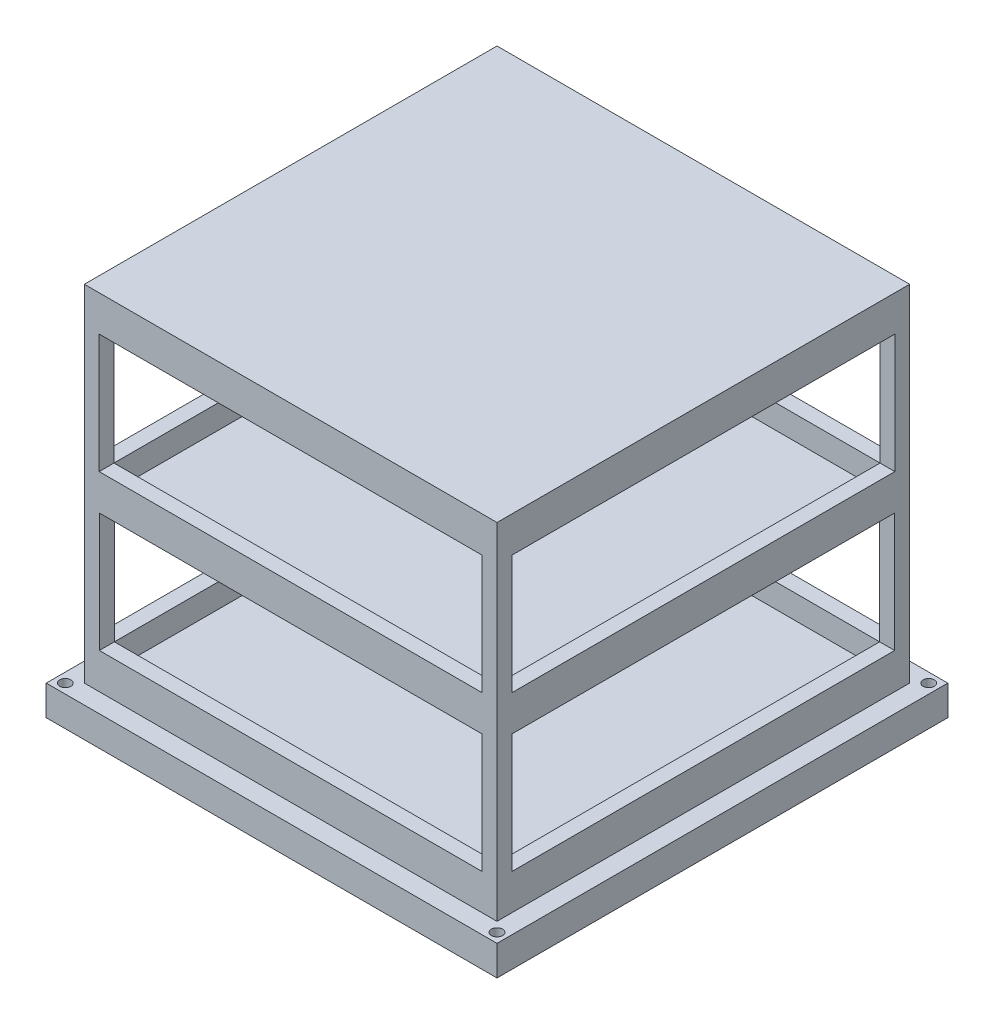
ISO-10303-21;
HEADER;
FILE_DESCRIPTION(('STEP AP214'),'2;1');
FILE_NAME('part.step','',(''),(''),'','','');
FILE_SCHEMA(('AUTOMOTIVE_DESIGN { 1 0 10303 214 1 1 1 1 }'));
ENDSEC;
DATA;
#1=APPLICATION_CONTEXT('core data for automotive mechanical design processes');
#2=APPLICATION_PROTOCOL_DEFINITION('international standard','automotive_design',2000,#1);
#3=PRODUCT_CONTEXT('',#1,'mechanical');
#4=PRODUCT('Part','Part','',(#3));
#5=PRODUCT_RELATED_PRODUCT_CATEGORY('part','',(#4));
#6=PRODUCT_DEFINITION_FORMATION('','',#4);
#7=PRODUCT_DEFINITION_CONTEXT('part definition',#1,'design');
#8=PRODUCT_DEFINITION('design','',#6,#7);
#9=PRODUCT_DEFINITION_SHAPE('','',#8);
#10=(LENGTH_UNIT() NAMED_UNIT(*) SI_UNIT(.MILLI.,.METRE.));
#11=(NAMED_UNIT(*) PLANE_ANGLE_UNIT() SI_UNIT($,.RADIAN.));
#12=(NAMED_UNIT(*) SI_UNIT($,.STERADIAN.) SOLID_ANGLE_UNIT());
#13=UNCERTAINTY_MEASURE_WITH_UNIT(LENGTH_MEASURE(1.E-05),#10,'distance_accuracy_value','');
#14=(GEOMETRIC_REPRESENTATION_CONTEXT(3) GLOBAL_UNCERTAINTY_ASSIGNED_CONTEXT((#13)) GLOBAL_UNIT_ASSIGNED_CONTEXT((#10,
#11,#12)) REPRESENTATION_CONTEXT('',''));
#15=CARTESIAN_POINT('',(0.,0.,0.));
#16=DIRECTION('',(0.,0.,1.));
#17=DIRECTION('',(1.,0.,0.));
#18=AXIS2_PLACEMENT_3D('',#15,#16,#17);
#19=CARTESIAN_POINT('',(0.,50.8,0.));
#20=DIRECTION('',(0.,1.,0.));
#21=DIRECTION('',(0.,0.,1.));
#22=AXIS2_PLACEMENT_3D('',#19,#20,#21);
#23=PLANE('',#22);
#24=DIRECTION('',(1.,0.,0.));
#25=VECTOR('',#24,1.);
#26=CARTESIAN_POINT('',(-51.054,50.8,51.054));
#27=LINE('',#26,#25);
#28=CARTESIAN_POINT('',(-51.054,50.8,51.054));
#29=VERTEX_POINT('',#28);
#30=CARTESIAN_POINT('',(51.054,50.8,51.054));
#31=VERTEX_POINT('',#30);
#32=EDGE_CURVE('E403',#29,#31,#27,.T.);
#33=ORIENTED_EDGE('',*,*,#32,.F.);
#34=DIRECTION('',(0.,0.,-1.));
#35=VECTOR('',#34,1.);
#36=CARTESIAN_POINT('',(-51.054,50.8,55.));
#37=LINE('',#36,#35);
#38=CARTESIAN_POINT('',(-51.054,50.8,55.));
#39=VERTEX_POINT('',#38);
#40=EDGE_CURVE('E331',#39,#29,#37,.T.);
#41=ORIENTED_EDGE('',*,*,#40,.F.);
#42=DIRECTION('',(1.,0.,0.));
#43=VECTOR('',#42,1.);
#44=CARTESIAN_POINT('',(-55.,50.8,55.));
#45=LINE('',#44,#43);
#46=CARTESIAN_POINT('',(51.054,50.8,55.));
#47=VERTEX_POINT('',#46);
#48=EDGE_CURVE('E436',#39,#47,#45,.T.);
#49=ORIENTED_EDGE('',*,*,#48,.T.);
#50=DIRECTION('',(0.,0.,1.));
#51=VECTOR('',#50,1.);
#52=CARTESIAN_POINT('',(51.054,50.8,55.));
#53=LINE('',#52,#51);
#54=EDGE_CURVE('E349',#31,#47,#53,.T.);
#55=ORIENTED_EDGE('',*,*,#54,.F.);
#56=EDGE_LOOP('',(#33,#41,#49,#55));
#57=FACE_BOUND('',#56,.T.);
#58=ADVANCED_FACE('F43',(#57),#23,.T.);
#59=DIRECTION('',(0.,0.,1.));
#60=VECTOR('',#59,1.);
#61=CARTESIAN_POINT('',(-55.,50.8,-55.));
#62=LINE('',#61,#60);
#63=CARTESIAN_POINT('',(-55.,50.8,-51.054));
#64=VERTEX_POINT('',#63);
#65=CARTESIAN_POINT('',(-55.,50.8,51.054));
#66=VERTEX_POINT('',#65);
#67=EDGE_CURVE('E58',#64,#66,#62,.T.);
#68=ORIENTED_EDGE('',*,*,#67,.T.);
#69=DIRECTION('',(-1.,0.,0.));
#70=VECTOR('',#69,1.);
#71=CARTESIAN_POINT('',(-55.,50.8,51.054));
#72=LINE('',#71,#70);
#73=EDGE_CURVE('E329',#29,#66,#72,.T.);
#74=ORIENTED_EDGE('',*,*,#73,.F.);
#75=DIRECTION('',(0.,0.,1.));
#76=VECTOR('',#75,1.);
#77=CARTESIAN_POINT('',(-51.054,50.8,51.054));
#78=LINE('',#77,#76);
#79=CARTESIAN_POINT('',(-51.054,50.8,-51.054));
#80=VERTEX_POINT('',#79);
#81=EDGE_CURVE('E418',#80,#29,#78,.T.);
#82=ORIENTED_EDGE('',*,*,#81,.F.);
#83=DIRECTION('',(1.,0.,0.));
#84=VECTOR('',#83,1.);
#85=CARTESIAN_POINT('',(-55.,50.8,-51.054));
#86=LINE('',#85,#84);
#87=EDGE_CURVE('E373',#64,#80,#86,.T.);
#88=ORIENTED_EDGE('',*,*,#87,.F.);
#89=EDGE_LOOP('',(#68,#74,#82,#88));
#90=FACE_BOUND('',#89,.T.);
#91=ADVANCED_FACE('F705',(#90),#23,.T.);
#92=DIRECTION('',(0.,0.,-1.));
#93=VECTOR('',#92,1.);
#94=CARTESIAN_POINT('',(51.054,50.8,51.054));
#95=LINE('',#94,#93);
#96=CARTESIAN_POINT('',(51.054,50.8,-51.054));
#97=VERTEX_POINT('',#96);
#98=EDGE_CURVE('E398',#31,#97,#95,.T.);
#99=ORIENTED_EDGE('',*,*,#98,.F.);
#100=DIRECTION('',(-1.,0.,0.));
#101=VECTOR('',#100,1.);
#102=CARTESIAN_POINT('',(55.,50.8,51.054));
#103=LINE('',#102,#101);
#104=CARTESIAN_POINT('',(55.,50.8,51.054));
#105=VERTEX_POINT('',#104);
#106=EDGE_CURVE('E66',#105,#31,#103,.T.);
#107=ORIENTED_EDGE('',*,*,#106,.F.);
#108=DIRECTION('',(0.,0.,-1.));
#109=VECTOR('',#108,1.);
#110=CARTESIAN_POINT('',(55.,50.8,-55.));
#111=LINE('',#110,#109);
#112=CARTESIAN_POINT('',(55.,50.8,-51.054));
#113=VERTEX_POINT('',#112);
#114=EDGE_CURVE('E439',#105,#113,#111,.T.);
#115=ORIENTED_EDGE('',*,*,#114,.T.);
#116=DIRECTION('',(1.,0.,0.));
#117=VECTOR('',#116,1.);
#118=CARTESIAN_POINT('',(55.,50.8,-51.054));
#119=LINE('',#118,#117);
#120=EDGE_CURVE('E366',#97,#113,#119,.T.);
#121=ORIENTED_EDGE('',*,*,#120,.F.);
#122=EDGE_LOOP('',(#99,#107,#115,#121));
#123=FACE_BOUND('',#122,.T.);
#124=ADVANCED_FACE('F667',(#123),#23,.T.);
#125=DIRECTION('',(-1.,0.,0.));
#126=VECTOR('',#125,1.);
#127=CARTESIAN_POINT('',(-51.054,50.8,-51.054));
#128=LINE('',#127,#126);
#129=EDGE_CURVE('E415',#97,#80,#128,.T.);
#130=ORIENTED_EDGE('',*,*,#129,.F.);
#131=DIRECTION('',(0.,0.,1.));
#132=VECTOR('',#131,1.);
#133=CARTESIAN_POINT('',(51.054,50.8,-55.));
#134=LINE('',#133,#132);
#135=CARTESIAN_POINT('',(51.054,50.8,-55.));
#136=VERTEX_POINT('',#135);
#137=EDGE_CURVE('E369',#136,#97,#134,.T.);
#138=ORIENTED_EDGE('',*,*,#137,.F.);
#139=DIRECTION('',(-1.,0.,0.));
#140=VECTOR('',#139,1.);
#141=CARTESIAN_POINT('',(-55.,50.8,-55.));
#142=LINE('',#141,#140);
#143=CARTESIAN_POINT('',(-51.054,50.8,-55.));
#144=VERTEX_POINT('',#143);
#145=EDGE_CURVE('E441',#136,#144,#142,.T.);
#146=ORIENTED_EDGE('',*,*,#145,.T.);
#147=DIRECTION('',(0.,0.,-1.));
#148=VECTOR('',#147,1.);
#149=CARTESIAN_POINT('',(-51.054,50.8,-55.));
#150=LINE('',#149,#148);
#151=EDGE_CURVE('E382',#80,#144,#150,.T.);
#152=ORIENTED_EDGE('',*,*,#151,.F.);
#153=EDGE_LOOP('',(#130,#138,#146,#152));
#154=FACE_BOUND('',#153,.T.);
#155=ADVANCED_FACE('F678',(#154),#23,.T.);
#156=CARTESIAN_POINT('',(0.,9.525,0.));
#157=DIRECTION('',(0.,-1.,0.));
#158=DIRECTION('',(0.,0.,-1.));
#159=AXIS2_PLACEMENT_3D('',#156,#157,#158);
#160=PLANE('',#159);
#161=DIRECTION('',(0.,0.,1.));
#162=VECTOR('',#161,1.);
#163=CARTESIAN_POINT('',(51.,9.525,-55.));
#164=LINE('',#163,#162);
#165=CARTESIAN_POINT('',(51.,9.525,-55.));
#166=VERTEX_POINT('',#165);
#167=CARTESIAN_POINT('',(51.,9.525,-51.));
#168=VERTEX_POINT('',#167);
#169=EDGE_CURVE('E466',#166,#168,#164,.T.);
#170=ORIENTED_EDGE('',*,*,#169,.F.);
#171=DIRECTION('',(-1.,0.,0.));
#172=VECTOR('',#171,1.);
#173=CARTESIAN_POINT('',(-55.,9.525,-55.));
#174=LINE('',#173,#172);
#175=CARTESIAN_POINT('',(-51.,9.525,-55.));
#176=VERTEX_POINT('',#175);
#177=EDGE_CURVE('E630',#166,#176,#174,.T.);
#178=ORIENTED_EDGE('',*,*,#177,.T.);
#179=DIRECTION('',(0.,0.,-1.));
#180=VECTOR('',#179,1.);
#181=CARTESIAN_POINT('',(-51.,9.525,-55.));
#182=LINE('',#181,#180);
#183=CARTESIAN_POINT('',(-51.,9.525,-51.));
#184=VERTEX_POINT('',#183);
#185=EDGE_CURVE('E521',#184,#176,#182,.T.);
#186=ORIENTED_EDGE('',*,*,#185,.F.);
#187=DIRECTION('',(-1.,0.,0.));
#188=VECTOR('',#187,1.);
#189=CARTESIAN_POINT('',(-51.,9.525,-51.));
#190=LINE('',#189,#188);
#191=EDGE_CURVE('E554',#168,#184,#190,.T.);
#192=ORIENTED_EDGE('',*,*,#191,.F.);
#193=EDGE_LOOP('',(#170,#178,#186,#192));
#194=FACE_BOUND('',#193,.T.);
#195=ADVANCED_FACE('F715',(#194),#160,.F.);
#196=DIRECTION('',(1.,0.,0.));
#197=VECTOR('',#196,1.);
#198=CARTESIAN_POINT('',(55.,9.525,-51.));
#199=LINE('',#198,#197);
#200=CARTESIAN_POINT('',(55.,9.525,-51.));
#201=VERTEX_POINT('',#200);
#202=EDGE_CURVE('E463',#168,#201,#199,.T.);
#203=ORIENTED_EDGE('',*,*,#202,.F.);
#204=DIRECTION('',(0.,0.,-1.));
#205=VECTOR('',#204,1.);
#206=CARTESIAN_POINT('',(51.,9.525,51.));
#207=LINE('',#206,#205);
#208=CARTESIAN_POINT('',(51.,9.525,51.));
#209=VERTEX_POINT('',#208);
#210=EDGE_CURVE('E537',#209,#168,#207,.T.);
#211=ORIENTED_EDGE('',*,*,#210,.F.);
#212=DIRECTION('',(-1.,0.,0.));
#213=VECTOR('',#212,1.);
#214=CARTESIAN_POINT('',(55.,9.525,51.));
#215=LINE('',#214,#213);
#216=CARTESIAN_POINT('',(55.,9.525,51.));
#217=VERTEX_POINT('',#216);
#218=EDGE_CURVE('E487',#217,#209,#215,.T.);
#219=ORIENTED_EDGE('',*,*,#218,.F.);
#220=DIRECTION('',(0.,0.,-1.));
#221=VECTOR('',#220,1.);
#222=CARTESIAN_POINT('',(55.,9.525,55.));
#223=LINE('',#222,#221);
#224=EDGE_CURVE('E628',#217,#201,#223,.T.);
#225=ORIENTED_EDGE('',*,*,#224,.T.);
#226=EDGE_LOOP('',(#203,#211,#219,#225));
#227=FACE_BOUND('',#226,.T.);
#228=ADVANCED_FACE('F814',(#227),#160,.F.);
#229=DIRECTION('',(0.,0.,1.));
#230=VECTOR('',#229,1.);
#231=CARTESIAN_POINT('',(51.,9.525,55.));
#232=LINE('',#231,#230);
#233=CARTESIAN_POINT('',(51.,9.525,55.));
#234=VERTEX_POINT('',#233);
#235=EDGE_CURVE('E484',#209,#234,#232,.T.);
#236=ORIENTED_EDGE('',*,*,#235,.F.);
#237=DIRECTION('',(1.,0.,0.));
#238=VECTOR('',#237,1.);
#239=CARTESIAN_POINT('',(-51.,9.525,51.));
#240=LINE('',#239,#238);
#241=CARTESIAN_POINT('',(-51.,9.525,51.));
#242=VERTEX_POINT('',#241);
#243=EDGE_CURVE('E542',#242,#209,#240,.T.);
#244=ORIENTED_EDGE('',*,*,#243,.F.);
#245=DIRECTION('',(0.,0.,-1.));
#246=VECTOR('',#245,1.);
#247=CARTESIAN_POINT('',(-51.,9.525,55.));
#248=LINE('',#247,#246);
#249=CARTESIAN_POINT('',(-51.,9.525,55.));
#250=VERTEX_POINT('',#249);
#251=EDGE_CURVE('E508',#250,#242,#248,.T.);
#252=ORIENTED_EDGE('',*,*,#251,.F.);
#253=DIRECTION('',(1.,0.,0.));
#254=VECTOR('',#253,1.);
#255=CARTESIAN_POINT('',(-55.,9.525,55.));
#256=LINE('',#255,#254);
#257=EDGE_CURVE('E635',#250,#234,#256,.T.);
#258=ORIENTED_EDGE('',*,*,#257,.T.);
#259=EDGE_LOOP('',(#236,#244,#252,#258));
#260=FACE_BOUND('',#259,.T.);
#261=ADVANCED_FACE('F1039',(#260),#160,.F.);
#262=DIRECTION('',(-1.,0.,0.));
#263=VECTOR('',#262,1.);
#264=CARTESIAN_POINT('',(-55.,9.525,51.));
#265=LINE('',#264,#263);
#266=CARTESIAN_POINT('',(-55.,9.525,51.));
#267=VERTEX_POINT('',#266);
#268=EDGE_CURVE('E505',#242,#267,#265,.T.);
#269=ORIENTED_EDGE('',*,*,#268,.F.);
#270=DIRECTION('',(0.,0.,1.));
#271=VECTOR('',#270,1.);
#272=CARTESIAN_POINT('',(-51.,9.525,51.));
#273=LINE('',#272,#271);
#274=EDGE_CURVE('E557',#184,#242,#273,.T.);
#275=ORIENTED_EDGE('',*,*,#274,.F.);
#276=DIRECTION('',(1.,0.,0.));
#277=VECTOR('',#276,1.);
#278=CARTESIAN_POINT('',(-55.,9.525,-51.));
#279=LINE('',#278,#277);
#280=CARTESIAN_POINT('',(-55.,9.525,-51.));
#281=VERTEX_POINT('',#280);
#282=EDGE_CURVE('E512',#281,#184,#279,.T.);
#283=ORIENTED_EDGE('',*,*,#282,.F.);
#284=DIRECTION('',(0.,0.,1.));
#285=VECTOR('',#284,1.);
#286=CARTESIAN_POINT('',(-55.,9.525,55.));
#287=LINE('',#286,#285);
#288=EDGE_CURVE('E633',#281,#267,#287,.T.);
#289=ORIENTED_EDGE('',*,*,#288,.T.);
#290=EDGE_LOOP('',(#269,#275,#283,#289));
#291=FACE_BOUND('',#290,.T.);
#292=ADVANCED_FACE('F652',(#291),#160,.F.);
#293=CARTESIAN_POINT('',(55.,9.525,55.));
#294=DIRECTION('',(-1.,0.,0.));
#295=DIRECTION('',(0.,0.,1.));
#296=AXIS2_PLACEMENT_3D('',#293,#294,#295);
#297=PLANE('',#296);
#298=DIRECTION('',(0.,-1.,0.));
#299=VECTOR('',#298,1.);
#300=CARTESIAN_POINT('',(55.,9.525,-55.));
#301=LINE('',#300,#299);
#302=CARTESIAN_POINT('',(55.,92.075,-55.));
#303=VERTEX_POINT('',#302);
#304=CARTESIAN_POINT('',(55.,0.,-55.));
#305=VERTEX_POINT('',#304);
#306=EDGE_CURVE('E11',#303,#305,#301,.T.);
#307=ORIENTED_EDGE('',*,*,#306,.F.);
#308=DIRECTION('',(0.,0.,-1.));
#309=VECTOR('',#308,1.);
#310=CARTESIAN_POINT('',(55.,92.075,-55.));
#311=LINE('',#310,#309);
#312=CARTESIAN_POINT('',(55.,92.075,55.));
#313=VERTEX_POINT('',#312);
#314=EDGE_CURVE('E297',#313,#303,#311,.T.);
#315=ORIENTED_EDGE('',*,*,#314,.F.);
#316=DIRECTION('',(0.,-1.,0.));
#317=VECTOR('',#316,1.);
#318=CARTESIAN_POINT('',(55.,9.525,55.));
#319=LINE('',#318,#317);
#320=CARTESIAN_POINT('',(55.,0.,55.));
#321=VERTEX_POINT('',#320);
#322=EDGE_CURVE('E287',#313,#321,#319,.T.);
#323=ORIENTED_EDGE('',*,*,#322,.T.);
#324=DIRECTION('',(0.,0.,-1.));
#325=VECTOR('',#324,1.);
#326=CARTESIAN_POINT('',(55.,0.,55.));
#327=LINE('',#326,#325);
#328=EDGE_CURVE('E627',#321,#305,#327,.T.);
#329=ORIENTED_EDGE('',*,*,#328,.T.);
#330=EDGE_LOOP('',(#307,#315,#323,#329));
#331=FACE_BOUND('',#330,.T.);
#332=DIRECTION('',(0.,-1.,0.));
#333=VECTOR('',#332,1.);
#334=CARTESIAN_POINT('',(55.,41.275,51.));
#335=LINE('',#334,#333);
#336=CARTESIAN_POINT('',(55.,41.275,51.));
#337=VERTEX_POINT('',#336);
#338=EDGE_CURVE('E470',#337,#217,#335,.T.);
#339=ORIENTED_EDGE('',*,*,#338,.F.);
#340=DIRECTION('',(0.,0.,-1.));
#341=VECTOR('',#340,1.);
#342=CARTESIAN_POINT('',(55.,41.275,-55.));
#343=LINE('',#342,#341);
#344=CARTESIAN_POINT('',(55.,41.275,-51.));
#345=VERTEX_POINT('',#344);
#346=EDGE_CURVE('E449',#337,#345,#343,.T.);
#347=ORIENTED_EDGE('',*,*,#346,.T.);
#348=DIRECTION('',(0.,-1.,0.));
#349=VECTOR('',#348,1.);
#350=CARTESIAN_POINT('',(55.,41.275,-51.));
#351=LINE('',#350,#349);
#352=EDGE_CURVE('E459',#345,#201,#351,.T.);
#353=ORIENTED_EDGE('',*,*,#352,.T.);
#354=ORIENTED_EDGE('',*,*,#224,.F.);
#355=EDGE_LOOP('',(#339,#347,#353,#354));
#356=FACE_BOUND('',#355,.T.);
#357=DIRECTION('',(0.,0.,-1.));
#358=VECTOR('',#357,1.);
#359=CARTESIAN_POINT('',(55.,82.55,-55.));
#360=LINE('',#359,#358);
#361=CARTESIAN_POINT('',(55.,82.55,51.054));
#362=VERTEX_POINT('',#361);
#363=CARTESIAN_POINT('',(55.,82.55,-51.054));
#364=VERTEX_POINT('',#363);
#365=EDGE_CURVE('E306',#362,#364,#360,.T.);
#366=ORIENTED_EDGE('',*,*,#365,.T.);
#367=DIRECTION('',(0.,-1.,0.));
#368=VECTOR('',#367,1.);
#369=CARTESIAN_POINT('',(55.,82.55,-51.054));
#370=LINE('',#369,#368);
#371=EDGE_CURVE('E362',#364,#113,#370,.T.);
#372=ORIENTED_EDGE('',*,*,#371,.T.);
#373=ORIENTED_EDGE('',*,*,#114,.F.);
#374=DIRECTION('',(0.,-1.,0.));
#375=VECTOR('',#374,1.);
#376=CARTESIAN_POINT('',(55.,82.55,51.054));
#377=LINE('',#376,#375);
#378=EDGE_CURVE('E335',#362,#105,#377,.T.);
#379=ORIENTED_EDGE('',*,*,#378,.F.);
#380=EDGE_LOOP('',(#366,#372,#373,#379));
#381=FACE_BOUND('',#380,.T.);
#382=ADVANCED_FACE('F45',(#331,#356,#381),#297,.F.);
#383=CARTESIAN_POINT('',(-55.,9.525,-55.));
#384=DIRECTION('',(0.,0.,1.));
#385=DIRECTION('',(1.,0.,0.));
#386=AXIS2_PLACEMENT_3D('',#383,#384,#385);
#387=PLANE('',#386);
#388=DIRECTION('',(0.,-1.,0.));
#389=VECTOR('',#388,1.);
#390=CARTESIAN_POINT('',(-55.,9.525,-55.));
#391=LINE('',#390,#389);
#392=CARTESIAN_POINT('',(-55.,92.075,-55.));
#393=VERTEX_POINT('',#392);
#394=CARTESIAN_POINT('',(-55.,0.,-55.));
#395=VERTEX_POINT('',#394);
#396=EDGE_CURVE('E51',#393,#395,#391,.T.);
#397=ORIENTED_EDGE('',*,*,#396,.F.);
#398=DIRECTION('',(-1.,0.,0.));
#399=VECTOR('',#398,1.);
#400=CARTESIAN_POINT('',(-55.,92.075,-55.));
#401=LINE('',#400,#399);
#402=EDGE_CURVE('E302',#303,#393,#401,.T.);
#403=ORIENTED_EDGE('',*,*,#402,.F.);
#404=ORIENTED_EDGE('',*,*,#306,.T.);
#405=DIRECTION('',(-1.,0.,0.));
#406=VECTOR('',#405,1.);
#407=CARTESIAN_POINT('',(-55.,0.,-55.));
#408=LINE('',#407,#406);
#409=EDGE_CURVE('E639',#305,#395,#408,.T.);
#410=ORIENTED_EDGE('',*,*,#409,.T.);
#411=EDGE_LOOP('',(#397,#403,#404,#410));
#412=FACE_BOUND('',#411,.T.);
#413=DIRECTION('',(-1.,0.,0.));
#414=VECTOR('',#413,1.);
#415=CARTESIAN_POINT('',(-55.,82.55,-55.));
#416=LINE('',#415,#414);
#417=CARTESIAN_POINT('',(51.054,82.55,-55.));
#418=VERTEX_POINT('',#417);
#419=CARTESIAN_POINT('',(-51.054,82.55,-55.));
#420=VERTEX_POINT('',#419);
#421=EDGE_CURVE('E303',#418,#420,#416,.T.);
#422=ORIENTED_EDGE('',*,*,#421,.T.);
#423=DIRECTION('',(0.,-1.,0.));
#424=VECTOR('',#423,1.);
#425=CARTESIAN_POINT('',(-51.054,82.55,-55.));
#426=LINE('',#425,#424);
#427=EDGE_CURVE('E385',#420,#144,#426,.T.);
#428=ORIENTED_EDGE('',*,*,#427,.T.);
#429=ORIENTED_EDGE('',*,*,#145,.F.);
#430=DIRECTION('',(0.,-1.,0.));
#431=VECTOR('',#430,1.);
#432=CARTESIAN_POINT('',(51.054,82.55,-55.));
#433=LINE('',#432,#431);
#434=EDGE_CURVE('E354',#418,#136,#433,.T.);
#435=ORIENTED_EDGE('',*,*,#434,.F.);
#436=EDGE_LOOP('',(#422,#428,#429,#435));
#437=FACE_BOUND('',#436,.T.);
#438=DIRECTION('',(-1.,0.,0.));
#439=VECTOR('',#438,1.);
#440=CARTESIAN_POINT('',(-55.,41.275,-55.));
#441=LINE('',#440,#439);
#442=CARTESIAN_POINT('',(51.,41.275,-55.));
#443=VERTEX_POINT('',#442);
#444=CARTESIAN_POINT('',(-51.,41.275,-55.));
#445=VERTEX_POINT('',#444);
#446=EDGE_CURVE('E437',#443,#445,#441,.T.);
#447=ORIENTED_EDGE('',*,*,#446,.T.);
#448=DIRECTION('',(0.,-1.,0.));
#449=VECTOR('',#448,1.);
#450=CARTESIAN_POINT('',(-51.,41.275,-55.));
#451=LINE('',#450,#449);
#452=EDGE_CURVE('E524',#445,#176,#451,.T.);
#453=ORIENTED_EDGE('',*,*,#452,.T.);
#454=ORIENTED_EDGE('',*,*,#177,.F.);
#455=DIRECTION('',(0.,-1.,0.));
#456=VECTOR('',#455,1.);
#457=CARTESIAN_POINT('',(51.,41.275,-55.));
#458=LINE('',#457,#456);
#459=EDGE_CURVE('E443',#443,#166,#458,.T.);
#460=ORIENTED_EDGE('',*,*,#459,.F.);
#461=EDGE_LOOP('',(#447,#453,#454,#460));
#462=FACE_BOUND('',#461,.T.);
#463=ADVANCED_FACE('F645',(#412,#437,#462),#387,.F.);
#464=CARTESIAN_POINT('',(-55.,9.525,55.));
#465=DIRECTION('',(1.,0.,0.));
#466=DIRECTION('',(0.,0.,-1.));
#467=AXIS2_PLACEMENT_3D('',#464,#465,#466);
#468=PLANE('',#467);
#469=DIRECTION('',(0.,-1.,0.));
#470=VECTOR('',#469,1.);
#471=CARTESIAN_POINT('',(-55.,82.55,-51.054));
#472=LINE('',#471,#470);
#473=CARTESIAN_POINT('',(-55.,82.55,-51.054));
#474=VERTEX_POINT('',#473);
#475=EDGE_CURVE('E395',#474,#64,#472,.T.);
#476=ORIENTED_EDGE('',*,*,#475,.F.);
#477=DIRECTION('',(0.,0.,1.));
#478=VECTOR('',#477,1.);
#479=CARTESIAN_POINT('',(-55.,82.55,-55.));
#480=LINE('',#479,#478);
#481=CARTESIAN_POINT('',(-55.,82.55,51.054));
#482=VERTEX_POINT('',#481);
#483=EDGE_CURVE('E312',#474,#482,#480,.T.);
#484=ORIENTED_EDGE('',*,*,#483,.T.);
#485=DIRECTION('',(0.,-1.,0.));
#486=VECTOR('',#485,1.);
#487=CARTESIAN_POINT('',(-55.,82.55,51.054));
#488=LINE('',#487,#486);
#489=EDGE_CURVE('E325',#482,#66,#488,.T.);
#490=ORIENTED_EDGE('',*,*,#489,.T.);
#491=ORIENTED_EDGE('',*,*,#67,.F.);
#492=EDGE_LOOP('',(#476,#484,#490,#491));
#493=FACE_BOUND('',#492,.T.);
#494=DIRECTION('',(0.,-1.,0.));
#495=VECTOR('',#494,1.);
#496=CARTESIAN_POINT('',(-55.,41.275,-51.));
#497=LINE('',#496,#495);
#498=CARTESIAN_POINT('',(-55.,41.275,-51.));
#499=VERTEX_POINT('',#498);
#500=EDGE_CURVE('E534',#499,#281,#497,.T.);
#501=ORIENTED_EDGE('',*,*,#500,.F.);
#502=DIRECTION('',(0.,0.,1.));
#503=VECTOR('',#502,1.);
#504=CARTESIAN_POINT('',(-55.,41.275,-55.));
#505=LINE('',#504,#503);
#506=CARTESIAN_POINT('',(-55.,41.275,51.));
#507=VERTEX_POINT('',#506);
#508=EDGE_CURVE('E426',#499,#507,#505,.T.);
#509=ORIENTED_EDGE('',*,*,#508,.T.);
#510=DIRECTION('',(0.,-1.,0.));
#511=VECTOR('',#510,1.);
#512=CARTESIAN_POINT('',(-55.,41.275,51.));
#513=LINE('',#512,#511);
#514=EDGE_CURVE('E501',#507,#267,#513,.T.);
#515=ORIENTED_EDGE('',*,*,#514,.T.);
#516=ORIENTED_EDGE('',*,*,#288,.F.);
#517=EDGE_LOOP('',(#501,#509,#515,#516));
#518=FACE_BOUND('',#517,.T.);
#519=DIRECTION('',(0.,0.,1.));
#520=VECTOR('',#519,1.);
#521=CARTESIAN_POINT('',(-55.,0.,55.));
#522=LINE('',#521,#520);
#523=CARTESIAN_POINT('',(-55.,0.,55.));
#524=VERTEX_POINT('',#523);
#525=EDGE_CURVE('E284',#395,#524,#522,.T.);
#526=ORIENTED_EDGE('',*,*,#525,.T.);
#527=DIRECTION('',(0.,-1.,0.));
#528=VECTOR('',#527,1.);
#529=CARTESIAN_POINT('',(-55.,9.525,55.));
#530=LINE('',#529,#528);
#531=CARTESIAN_POINT('',(-55.,92.075,55.));
#532=VERTEX_POINT('',#531);
#533=EDGE_CURVE('E278',#532,#524,#530,.T.);
#534=ORIENTED_EDGE('',*,*,#533,.F.);
#535=DIRECTION('',(0.,0.,1.));
#536=VECTOR('',#535,1.);
#537=CARTESIAN_POINT('',(-55.,92.075,-55.));
#538=LINE('',#537,#536);
#539=EDGE_CURVE('E283',#393,#532,#538,.T.);
#540=ORIENTED_EDGE('',*,*,#539,.F.);
#541=ORIENTED_EDGE('',*,*,#396,.T.);
#542=EDGE_LOOP('',(#526,#534,#540,#541));
#543=FACE_BOUND('',#542,.T.);
#544=ADVANCED_FACE('F280',(#493,#518,#543),#468,.F.);
#545=CARTESIAN_POINT('',(-55.,9.525,55.));
#546=DIRECTION('',(0.,0.,-1.));
#547=DIRECTION('',(-1.,0.,0.));
#548=AXIS2_PLACEMENT_3D('',#545,#546,#547);
#549=PLANE('',#548);
#550=ORIENTED_EDGE('',*,*,#322,.F.);
#551=DIRECTION('',(1.,0.,0.));
#552=VECTOR('',#551,1.);
#553=CARTESIAN_POINT('',(-55.,92.075,55.));
#554=LINE('',#553,#552);
#555=EDGE_CURVE('E290',#532,#313,#554,.T.);
#556=ORIENTED_EDGE('',*,*,#555,.F.);
#557=ORIENTED_EDGE('',*,*,#533,.T.);
#558=DIRECTION('',(1.,0.,0.));
#559=VECTOR('',#558,1.);
#560=CARTESIAN_POINT('',(-55.,0.,55.));
#561=LINE('',#560,#559);
#562=EDGE_CURVE('E631',#524,#321,#561,.T.);
#563=ORIENTED_EDGE('',*,*,#562,.T.);
#564=EDGE_LOOP('',(#550,#556,#557,#563));
#565=FACE_BOUND('',#564,.T.);
#566=DIRECTION('',(0.,-1.,0.));
#567=VECTOR('',#566,1.);
#568=CARTESIAN_POINT('',(-51.,41.275,55.));
#569=LINE('',#568,#567);
#570=CARTESIAN_POINT('',(-51.,41.275,55.));
#571=VERTEX_POINT('',#570);
#572=EDGE_CURVE('E491',#571,#250,#569,.T.);
#573=ORIENTED_EDGE('',*,*,#572,.F.);
#574=DIRECTION('',(1.,0.,0.));
#575=VECTOR('',#574,1.);
#576=CARTESIAN_POINT('',(-55.,41.275,55.));
#577=LINE('',#576,#575);
#578=CARTESIAN_POINT('',(51.,41.275,55.));
#579=VERTEX_POINT('',#578);
#580=EDGE_CURVE('E446',#571,#579,#577,.T.);
#581=ORIENTED_EDGE('',*,*,#580,.T.);
#582=DIRECTION('',(0.,-1.,0.));
#583=VECTOR('',#582,1.);
#584=CARTESIAN_POINT('',(51.,41.275,55.));
#585=LINE('',#584,#583);
#586=EDGE_CURVE('E480',#579,#234,#585,.T.);
#587=ORIENTED_EDGE('',*,*,#586,.T.);
#588=ORIENTED_EDGE('',*,*,#257,.F.);
#589=EDGE_LOOP('',(#573,#581,#587,#588));
#590=FACE_BOUND('',#589,.T.);
#591=DIRECTION('',(1.,0.,0.));
#592=VECTOR('',#591,1.);
#593=CARTESIAN_POINT('',(-55.,82.55,55.));
#594=LINE('',#593,#592);
#595=CARTESIAN_POINT('',(-51.054,82.55,55.));
#596=VERTEX_POINT('',#595);
#597=CARTESIAN_POINT('',(51.054,82.55,55.));
#598=VERTEX_POINT('',#597);
#599=EDGE_CURVE('E315',#596,#598,#594,.T.);
#600=ORIENTED_EDGE('',*,*,#599,.T.);
#601=DIRECTION('',(0.,-1.,0.));
#602=VECTOR('',#601,1.);
#603=CARTESIAN_POINT('',(51.054,82.55,55.));
#604=LINE('',#603,#602);
#605=EDGE_CURVE('E345',#598,#47,#604,.T.);
#606=ORIENTED_EDGE('',*,*,#605,.T.);
#607=ORIENTED_EDGE('',*,*,#48,.F.);
#608=DIRECTION('',(0.,-1.,0.));
#609=VECTOR('',#608,1.);
#610=CARTESIAN_POINT('',(-51.054,82.55,55.));
#611=LINE('',#610,#609);
#612=EDGE_CURVE('E311',#596,#39,#611,.T.);
#613=ORIENTED_EDGE('',*,*,#612,.F.);
#614=EDGE_LOOP('',(#600,#606,#607,#613));
#615=FACE_BOUND('',#614,.T.);
#616=ADVANCED_FACE('F291',(#565,#590,#615),#549,.F.);
#617=CARTESIAN_POINT('',(0.,0.,0.));
#618=DIRECTION('',(0.,1.,0.));
#619=DIRECTION('',(0.,0.,1.));
#620=AXIS2_PLACEMENT_3D('',#617,#618,#619);
#621=PLANE('',#620);
#622=CARTESIAN_POINT('',(-57.54,0.,57.54));
#623=DIRECTION('',(0.,1.,0.));
#624=DIRECTION('',(0.,0.,-1.));
#625=AXIS2_PLACEMENT_3D('',#622,#623,#624);
#626=CIRCLE('',#625,1.5);
#627=CARTESIAN_POINT('',(-57.54,0.,56.04));
#628=VERTEX_POINT('',#627);
#629=EDGE_CURVE('E587',#628,#628,#626,.T.);
#630=ORIENTED_EDGE('',*,*,#629,.F.);
#631=EDGE_LOOP('',(#630));
#632=FACE_BOUND('',#631,.T.);
#633=CARTESIAN_POINT('',(57.54,0.,57.54));
#634=DIRECTION('',(0.,1.,0.));
#635=DIRECTION('',(0.,0.,1.));
#636=AXIS2_PLACEMENT_3D('',#633,#634,#635);
#637=CIRCLE('',#636,1.5);
#638=CARTESIAN_POINT('',(57.54,0.,59.04));
#639=VERTEX_POINT('',#638);
#640=EDGE_CURVE('E581',#639,#639,#637,.T.);
#641=ORIENTED_EDGE('',*,*,#640,.F.);
#642=EDGE_LOOP('',(#641));
#643=FACE_BOUND('',#642,.T.);
#644=CARTESIAN_POINT('',(57.54,0.,-57.54));
#645=DIRECTION('',(0.,1.,0.));
#646=DIRECTION('',(0.,0.,-1.));
#647=AXIS2_PLACEMENT_3D('',#644,#645,#646);
#648=CIRCLE('',#647,1.5);
#649=CARTESIAN_POINT('',(57.54,0.,-59.04));
#650=VERTEX_POINT('',#649);
#651=EDGE_CURVE('E574',#650,#650,#648,.T.);
#652=ORIENTED_EDGE('',*,*,#651,.F.);
#653=EDGE_LOOP('',(#652));
#654=FACE_BOUND('',#653,.T.);
#655=CARTESIAN_POINT('',(-57.54,0.,-57.54));
#656=DIRECTION('',(0.,1.,0.));
#657=DIRECTION('',(0.,0.,1.));
#658=AXIS2_PLACEMENT_3D('',#655,#656,#657);
#659=CIRCLE('',#658,1.5);
#660=CARTESIAN_POINT('',(-57.54,0.,-56.04));
#661=VERTEX_POINT('',#660);
#662=EDGE_CURVE('E577',#661,#661,#659,.T.);
#663=ORIENTED_EDGE('',*,*,#662,.F.);
#664=EDGE_LOOP('',(#663));
#665=FACE_BOUND('',#664,.T.);
#666=DIRECTION('',(0.,0.,1.));
#667=VECTOR('',#666,1.);
#668=CARTESIAN_POINT('',(60.08,0.,-60.08));
#669=LINE('',#668,#667);
#670=CARTESIAN_POINT('',(60.08,0.,-60.08));
#671=VERTEX_POINT('',#670);
#672=CARTESIAN_POINT('',(60.08,0.,60.08));
#673=VERTEX_POINT('',#672);
#674=EDGE_CURVE('E595',#671,#673,#669,.T.);
#675=ORIENTED_EDGE('',*,*,#674,.F.);
#676=DIRECTION('',(1.,0.,0.));
#677=VECTOR('',#676,1.);
#678=CARTESIAN_POINT('',(-60.08,0.,-60.08));
#679=LINE('',#678,#677);
#680=CARTESIAN_POINT('',(-60.08,0.,-60.08));
#681=VERTEX_POINT('',#680);
#682=EDGE_CURVE('E602',#681,#671,#679,.T.);
#683=ORIENTED_EDGE('',*,*,#682,.F.);
#684=DIRECTION('',(0.,0.,-1.));
#685=VECTOR('',#684,1.);
#686=CARTESIAN_POINT('',(-60.08,0.,-60.08));
#687=LINE('',#686,#685);
#688=CARTESIAN_POINT('',(-60.08,0.,60.08));
#689=VERTEX_POINT('',#688);
#690=EDGE_CURVE('E613',#689,#681,#687,.T.);
#691=ORIENTED_EDGE('',*,*,#690,.F.);
#692=DIRECTION('',(-1.,0.,0.));
#693=VECTOR('',#692,1.);
#694=CARTESIAN_POINT('',(-60.08,0.,60.08));
#695=LINE('',#694,#693);
#696=EDGE_CURVE('E611',#673,#689,#695,.T.);
#697=ORIENTED_EDGE('',*,*,#696,.F.);
#698=EDGE_LOOP('',(#675,#683,#691,#697));
#699=FACE_BOUND('',#698,.T.);
#700=ORIENTED_EDGE('',*,*,#328,.F.);
#701=ORIENTED_EDGE('',*,*,#562,.F.);
#702=ORIENTED_EDGE('',*,*,#525,.F.);
#703=ORIENTED_EDGE('',*,*,#409,.F.);
#704=EDGE_LOOP('',(#700,#701,#702,#703));
#705=FACE_BOUND('',#704,.T.);
#706=ADVANCED_FACE('F648',(#632,#643,#654,#665,#699,#705),#621,.T.);
#707=CARTESIAN_POINT('',(60.08,-8.,-60.08));
#708=DIRECTION('',(-1.,0.,0.));
#709=DIRECTION('',(0.,0.,1.));
#710=AXIS2_PLACEMENT_3D('',#707,#708,#709);
#711=PLANE('',#710);
#712=ORIENTED_EDGE('',*,*,#674,.T.);
#713=DIRECTION('',(0.,1.,0.));
#714=VECTOR('',#713,1.);
#715=CARTESIAN_POINT('',(60.08,-8.,60.08));
#716=LINE('',#715,#714);
#717=CARTESIAN_POINT('',(60.08,-8.,60.08));
#718=VERTEX_POINT('',#717);
#719=EDGE_CURVE('E624',#718,#673,#716,.T.);
#720=ORIENTED_EDGE('',*,*,#719,.F.);
#721=DIRECTION('',(0.,0.,1.));
#722=VECTOR('',#721,1.);
#723=CARTESIAN_POINT('',(60.08,-8.,-60.08));
#724=LINE('',#723,#722);
#725=CARTESIAN_POINT('',(60.08,-8.,-60.08));
#726=VERTEX_POINT('',#725);
#727=EDGE_CURVE('E598',#726,#718,#724,.T.);
#728=ORIENTED_EDGE('',*,*,#727,.F.);
#729=DIRECTION('',(0.,1.,0.));
#730=VECTOR('',#729,1.);
#731=CARTESIAN_POINT('',(60.08,-8.,-60.08));
#732=LINE('',#731,#730);
#733=EDGE_CURVE('E608',#726,#671,#732,.T.);
#734=ORIENTED_EDGE('',*,*,#733,.T.);
#735=EDGE_LOOP('',(#712,#720,#728,#734));
#736=FACE_BOUND('',#735,.T.);
#737=ADVANCED_FACE('F796',(#736),#711,.F.);
#738=CARTESIAN_POINT('',(-60.08,-8.,60.08));
#739=DIRECTION('',(0.,0.,-1.));
#740=DIRECTION('',(-1.,0.,0.));
#741=AXIS2_PLACEMENT_3D('',#738,#739,#740);
#742=PLANE('',#741);
#743=ORIENTED_EDGE('',*,*,#696,.T.);
#744=DIRECTION('',(0.,1.,0.));
#745=VECTOR('',#744,1.);
#746=CARTESIAN_POINT('',(-60.08,-8.,60.08));
#747=LINE('',#746,#745);
#748=CARTESIAN_POINT('',(-60.08,-8.,60.08));
#749=VERTEX_POINT('',#748);
#750=EDGE_CURVE('E621',#749,#689,#747,.T.);
#751=ORIENTED_EDGE('',*,*,#750,.F.);
#752=DIRECTION('',(-1.,0.,0.));
#753=VECTOR('',#752,1.);
#754=CARTESIAN_POINT('',(-60.08,-8.,60.08));
#755=LINE('',#754,#753);
#756=EDGE_CURVE('E601',#718,#749,#755,.T.);
#757=ORIENTED_EDGE('',*,*,#756,.F.);
#758=ORIENTED_EDGE('',*,*,#719,.T.);
#759=EDGE_LOOP('',(#743,#751,#757,#758));
#760=FACE_BOUND('',#759,.T.);
#761=ADVANCED_FACE('F804',(#760),#742,.F.);
#762=CARTESIAN_POINT('',(-60.08,-8.,-60.08));
#763=DIRECTION('',(1.,0.,0.));
#764=DIRECTION('',(0.,0.,-1.));
#765=AXIS2_PLACEMENT_3D('',#762,#763,#764);
#766=PLANE('',#765);
#767=ORIENTED_EDGE('',*,*,#690,.T.);
#768=DIRECTION('',(0.,1.,0.));
#769=VECTOR('',#768,1.);
#770=CARTESIAN_POINT('',(-60.08,-8.,-60.08));
#771=LINE('',#770,#769);
#772=CARTESIAN_POINT('',(-60.08,-8.,-60.08));
#773=VERTEX_POINT('',#772);
#774=EDGE_CURVE('E618',#773,#681,#771,.T.);
#775=ORIENTED_EDGE('',*,*,#774,.F.);
#776=DIRECTION('',(0.,0.,-1.));
#777=VECTOR('',#776,1.);
#778=CARTESIAN_POINT('',(-60.08,-8.,-60.08));
#779=LINE('',#778,#777);
#780=EDGE_CURVE('E604',#749,#773,#779,.T.);
#781=ORIENTED_EDGE('',*,*,#780,.F.);
#782=ORIENTED_EDGE('',*,*,#750,.T.);
#783=EDGE_LOOP('',(#767,#775,#781,#782));
#784=FACE_BOUND('',#783,.T.);
#785=ADVANCED_FACE('F800',(#784),#766,.F.);
#786=CARTESIAN_POINT('',(-60.08,-8.,-60.08));
#787=DIRECTION('',(0.,0.,1.));
#788=DIRECTION('',(1.,0.,0.));
#789=AXIS2_PLACEMENT_3D('',#786,#787,#788);
#790=PLANE('',#789);
#791=ORIENTED_EDGE('',*,*,#682,.T.);
#792=ORIENTED_EDGE('',*,*,#733,.F.);
#793=DIRECTION('',(1.,0.,0.));
#794=VECTOR('',#793,1.);
#795=CARTESIAN_POINT('',(-60.08,-8.,-60.08));
#796=LINE('',#795,#794);
#797=EDGE_CURVE('E606',#773,#726,#796,.T.);
#798=ORIENTED_EDGE('',*,*,#797,.F.);
#799=ORIENTED_EDGE('',*,*,#774,.T.);
#800=EDGE_LOOP('',(#791,#792,#798,#799));
#801=FACE_BOUND('',#800,.T.);
#802=ADVANCED_FACE('F792',(#801),#790,.F.);
#803=CARTESIAN_POINT('',(0.,-8.,0.));
#804=DIRECTION('',(0.,1.,0.));
#805=DIRECTION('',(0.,0.,1.));
#806=AXIS2_PLACEMENT_3D('',#803,#804,#805);
#807=PLANE('',#806);
#808=CARTESIAN_POINT('',(-57.54,-8.,57.54));
#809=DIRECTION('',(0.,1.,0.));
#810=DIRECTION('',(0.,0.,-1.));
#811=AXIS2_PLACEMENT_3D('',#808,#809,#810);
#812=CIRCLE('',#811,1.5);
#813=CARTESIAN_POINT('',(-57.54,-8.,56.04));
#814=VERTEX_POINT('',#813);
#815=EDGE_CURVE('E565',#814,#814,#812,.T.);
#816=ORIENTED_EDGE('',*,*,#815,.T.);
#817=EDGE_LOOP('',(#816));
#818=FACE_BOUND('',#817,.T.);
#819=CARTESIAN_POINT('',(57.54,-8.,57.54));
#820=DIRECTION('',(0.,1.,0.));
#821=DIRECTION('',(0.,0.,1.));
#822=AXIS2_PLACEMENT_3D('',#819,#820,#821);
#823=CIRCLE('',#822,1.5);
#824=CARTESIAN_POINT('',(57.54,-8.,59.04));
#825=VERTEX_POINT('',#824);
#826=EDGE_CURVE('E584',#825,#825,#823,.T.);
#827=ORIENTED_EDGE('',*,*,#826,.T.);
#828=EDGE_LOOP('',(#827));
#829=FACE_BOUND('',#828,.T.);
#830=CARTESIAN_POINT('',(57.54,-8.,-57.54));
#831=DIRECTION('',(0.,1.,0.));
#832=DIRECTION('',(0.,0.,-1.));
#833=AXIS2_PLACEMENT_3D('',#830,#831,#832);
#834=CIRCLE('',#833,1.5);
#835=CARTESIAN_POINT('',(57.54,-8.,-59.04));
#836=VERTEX_POINT('',#835);
#837=EDGE_CURVE('E578',#836,#836,#834,.T.);
#838=ORIENTED_EDGE('',*,*,#837,.T.);
#839=EDGE_LOOP('',(#838));
#840=FACE_BOUND('',#839,.T.);
#841=CARTESIAN_POINT('',(-57.54,-8.,-57.54));
#842=DIRECTION('',(0.,1.,0.));
#843=DIRECTION('',(0.,0.,1.));
#844=AXIS2_PLACEMENT_3D('',#841,#842,#843);
#845=CIRCLE('',#844,1.5);
#846=CARTESIAN_POINT('',(-57.54,-8.,-56.04));
#847=VERTEX_POINT('',#846);
#848=EDGE_CURVE('E592',#847,#847,#845,.T.);
#849=ORIENTED_EDGE('',*,*,#848,.T.);
#850=EDGE_LOOP('',(#849));
#851=FACE_BOUND('',#850,.T.);
#852=ORIENTED_EDGE('',*,*,#727,.T.);
#853=ORIENTED_EDGE('',*,*,#756,.T.);
#854=ORIENTED_EDGE('',*,*,#780,.T.);
#855=ORIENTED_EDGE('',*,*,#797,.T.);
#856=EDGE_LOOP('',(#852,#853,#854,#855));
#857=FACE_BOUND('',#856,.T.);
#858=ADVANCED_FACE('F788',(#818,#829,#840,#851,#857),#807,.F.);
#859=CARTESIAN_POINT('',(-57.54,-8.,-57.54));
#860=DIRECTION('',(0.,1.,0.));
#861=DIRECTION('',(0.,0.,1.));
#862=AXIS2_PLACEMENT_3D('',#859,#860,#861);
#863=CYLINDRICAL_SURFACE('',#862,1.5);
#864=ORIENTED_EDGE('',*,*,#848,.F.);
#865=EDGE_LOOP('',(#864));
#866=FACE_BOUND('',#865,.T.);
#867=ORIENTED_EDGE('',*,*,#662,.T.);
#868=EDGE_LOOP('',(#867));
#869=FACE_BOUND('',#868,.T.);
#870=ADVANCED_FACE('F778',(#866,#869),#863,.F.);
#871=CARTESIAN_POINT('',(57.54,-8.,-57.54));
#872=DIRECTION('',(0.,1.,0.));
#873=DIRECTION('',(0.,0.,1.));
#874=AXIS2_PLACEMENT_3D('',#871,#872,#873);
#875=CYLINDRICAL_SURFACE('',#874,1.5);
#876=ORIENTED_EDGE('',*,*,#837,.F.);
#877=EDGE_LOOP('',(#876));
#878=FACE_BOUND('',#877,.T.);
#879=ORIENTED_EDGE('',*,*,#651,.T.);
#880=EDGE_LOOP('',(#879));
#881=FACE_BOUND('',#880,.T.);
#882=ADVANCED_FACE('F774',(#878,#881),#875,.F.);
#883=CARTESIAN_POINT('',(57.54,-8.,57.54));
#884=DIRECTION('',(0.,1.,0.));
#885=DIRECTION('',(0.,0.,1.));
#886=AXIS2_PLACEMENT_3D('',#883,#884,#885);
#887=CYLINDRICAL_SURFACE('',#886,1.5);
#888=ORIENTED_EDGE('',*,*,#826,.F.);
#889=EDGE_LOOP('',(#888));
#890=FACE_BOUND('',#889,.T.);
#891=ORIENTED_EDGE('',*,*,#640,.T.);
#892=EDGE_LOOP('',(#891));
#893=FACE_BOUND('',#892,.T.);
#894=ADVANCED_FACE('F777',(#890,#893),#887,.F.);
#895=CARTESIAN_POINT('',(-57.54,-8.,57.54));
#896=DIRECTION('',(0.,1.,0.));
#897=DIRECTION('',(0.,0.,1.));
#898=AXIS2_PLACEMENT_3D('',#895,#896,#897);
#899=CYLINDRICAL_SURFACE('',#898,1.5);
#900=ORIENTED_EDGE('',*,*,#815,.F.);
#901=EDGE_LOOP('',(#900));
#902=FACE_BOUND('',#901,.T.);
#903=ORIENTED_EDGE('',*,*,#629,.T.);
#904=EDGE_LOOP('',(#903));
#905=FACE_BOUND('',#904,.T.);
#906=ADVANCED_FACE('F772',(#902,#905),#899,.F.);
#907=CARTESIAN_POINT('',(51.,3.175,51.));
#908=DIRECTION('',(1.,0.,0.));
#909=DIRECTION('',(0.,0.,-1.));
#910=AXIS2_PLACEMENT_3D('',#907,#908,#909);
#911=PLANE('',#910);
#912=ORIENTED_EDGE('',*,*,#210,.T.);
#913=DIRECTION('',(0.,1.,0.));
#914=VECTOR('',#913,1.);
#915=CARTESIAN_POINT('',(51.,3.175,-51.));
#916=LINE('',#915,#914);
#917=CARTESIAN_POINT('',(51.,3.175,-51.));
#918=VERTEX_POINT('',#917);
#919=EDGE_CURVE('E551',#918,#168,#916,.T.);
#920=ORIENTED_EDGE('',*,*,#919,.F.);
#921=DIRECTION('',(0.,0.,-1.));
#922=VECTOR('',#921,1.);
#923=CARTESIAN_POINT('',(51.,3.175,51.));
#924=LINE('',#923,#922);
#925=CARTESIAN_POINT('',(51.,3.175,51.));
#926=VERTEX_POINT('',#925);
#927=EDGE_CURVE('E538',#926,#918,#924,.T.);
#928=ORIENTED_EDGE('',*,*,#927,.F.);
#929=DIRECTION('',(0.,1.,0.));
#930=VECTOR('',#929,1.);
#931=CARTESIAN_POINT('',(51.,3.175,51.));
#932=LINE('',#931,#930);
#933=EDGE_CURVE('E562',#926,#209,#932,.T.);
#934=ORIENTED_EDGE('',*,*,#933,.T.);
#935=EDGE_LOOP('',(#912,#920,#928,#934));
#936=FACE_BOUND('',#935,.T.);
#937=ADVANCED_FACE('F762',(#936),#911,.F.);
#938=CARTESIAN_POINT('',(-51.,3.175,51.));
#939=DIRECTION('',(0.,0.,1.));
#940=DIRECTION('',(1.,0.,0.));
#941=AXIS2_PLACEMENT_3D('',#938,#939,#940);
#942=PLANE('',#941);
#943=ORIENTED_EDGE('',*,*,#243,.T.);
#944=ORIENTED_EDGE('',*,*,#933,.F.);
#945=DIRECTION('',(1.,0.,0.));
#946=VECTOR('',#945,1.);
#947=CARTESIAN_POINT('',(-51.,3.175,51.));
#948=LINE('',#947,#946);
#949=CARTESIAN_POINT('',(-51.,3.175,51.));
#950=VERTEX_POINT('',#949);
#951=EDGE_CURVE('E548',#950,#926,#948,.T.);
#952=ORIENTED_EDGE('',*,*,#951,.F.);
#953=DIRECTION('',(0.,1.,0.));
#954=VECTOR('',#953,1.);
#955=CARTESIAN_POINT('',(-51.,3.175,51.));
#956=LINE('',#955,#954);
#957=EDGE_CURVE('E566',#950,#242,#956,.T.);
#958=ORIENTED_EDGE('',*,*,#957,.T.);
#959=EDGE_LOOP('',(#943,#944,#952,#958));
#960=FACE_BOUND('',#959,.T.);
#961=ADVANCED_FACE('F758',(#960),#942,.F.);
#962=CARTESIAN_POINT('',(-51.,3.175,51.));
#963=DIRECTION('',(-1.,0.,0.));
#964=DIRECTION('',(0.,0.,1.));
#965=AXIS2_PLACEMENT_3D('',#962,#963,#964);
#966=PLANE('',#965);
#967=ORIENTED_EDGE('',*,*,#274,.T.);
#968=ORIENTED_EDGE('',*,*,#957,.F.);
#969=DIRECTION('',(0.,0.,1.));
#970=VECTOR('',#969,1.);
#971=CARTESIAN_POINT('',(-51.,3.175,51.));
#972=LINE('',#971,#970);
#973=CARTESIAN_POINT('',(-51.,3.175,-51.));
#974=VERTEX_POINT('',#973);
#975=EDGE_CURVE('E545',#974,#950,#972,.T.);
#976=ORIENTED_EDGE('',*,*,#975,.F.);
#977=DIRECTION('',(0.,1.,0.));
#978=VECTOR('',#977,1.);
#979=CARTESIAN_POINT('',(-51.,3.175,-51.));
#980=LINE('',#979,#978);
#981=EDGE_CURVE('E569',#974,#184,#980,.T.);
#982=ORIENTED_EDGE('',*,*,#981,.T.);
#983=EDGE_LOOP('',(#967,#968,#976,#982));
#984=FACE_BOUND('',#983,.T.);
#985=ADVANCED_FACE('F761',(#984),#966,.F.);
#986=CARTESIAN_POINT('',(-51.,3.175,-51.));
#987=DIRECTION('',(0.,0.,-1.));
#988=DIRECTION('',(-1.,0.,0.));
#989=AXIS2_PLACEMENT_3D('',#986,#987,#988);
#990=PLANE('',#989);
#991=ORIENTED_EDGE('',*,*,#191,.T.);
#992=ORIENTED_EDGE('',*,*,#981,.F.);
#993=DIRECTION('',(-1.,0.,0.));
#994=VECTOR('',#993,1.);
#995=CARTESIAN_POINT('',(-51.,3.175,-51.));
#996=LINE('',#995,#994);
#997=EDGE_CURVE('E541',#918,#974,#996,.T.);
#998=ORIENTED_EDGE('',*,*,#997,.F.);
#999=ORIENTED_EDGE('',*,*,#919,.T.);
#1000=EDGE_LOOP('',(#991,#992,#998,#999));
#1001=FACE_BOUND('',#1000,.T.);
#1002=ADVANCED_FACE('F756',(#1001),#990,.F.);
#1003=CARTESIAN_POINT('',(0.,3.175,0.));
#1004=DIRECTION('',(0.,-1.,0.));
#1005=DIRECTION('',(0.,0.,-1.));
#1006=AXIS2_PLACEMENT_3D('',#1003,#1004,#1005);
#1007=PLANE('',#1006);
#1008=ORIENTED_EDGE('',*,*,#927,.T.);
#1009=ORIENTED_EDGE('',*,*,#997,.T.);
#1010=ORIENTED_EDGE('',*,*,#975,.T.);
#1011=ORIENTED_EDGE('',*,*,#951,.T.);
#1012=EDGE_LOOP('',(#1008,#1009,#1010,#1011));
#1013=FACE_BOUND('',#1012,.T.);
#1014=ADVANCED_FACE('F752',(#1013),#1007,.F.);
#1015=CARTESIAN_POINT('',(-55.,41.275,-51.));
#1016=DIRECTION('',(0.,0.,-1.));
#1017=DIRECTION('',(-1.,0.,0.));
#1018=AXIS2_PLACEMENT_3D('',#1015,#1016,#1017);
#1019=PLANE('',#1018);
#1020=ORIENTED_EDGE('',*,*,#282,.T.);
#1021=DIRECTION('',(0.,-1.,0.));
#1022=VECTOR('',#1021,1.);
#1023=CARTESIAN_POINT('',(-51.,41.275,-51.));
#1024=LINE('',#1023,#1022);
#1025=CARTESIAN_POINT('',(-51.,41.275,-51.));
#1026=VERTEX_POINT('',#1025);
#1027=EDGE_CURVE('E531',#1026,#184,#1024,.T.);
#1028=ORIENTED_EDGE('',*,*,#1027,.F.);
#1029=DIRECTION('',(1.,0.,0.));
#1030=VECTOR('',#1029,1.);
#1031=CARTESIAN_POINT('',(-55.,41.275,-51.));
#1032=LINE('',#1031,#1030);
#1033=EDGE_CURVE('E517',#499,#1026,#1032,.T.);
#1034=ORIENTED_EDGE('',*,*,#1033,.F.);
#1035=ORIENTED_EDGE('',*,*,#500,.T.);
#1036=EDGE_LOOP('',(#1020,#1028,#1034,#1035));
#1037=FACE_BOUND('',#1036,.T.);
#1038=ADVANCED_FACE('F748',(#1037),#1019,.F.);
#1039=CARTESIAN_POINT('',(-51.,41.275,-55.));
#1040=DIRECTION('',(-1.,0.,0.));
#1041=DIRECTION('',(0.,0.,1.));
#1042=AXIS2_PLACEMENT_3D('',#1039,#1040,#1041);
#1043=PLANE('',#1042);
#1044=ORIENTED_EDGE('',*,*,#185,.T.);
#1045=ORIENTED_EDGE('',*,*,#452,.F.);
#1046=DIRECTION('',(0.,0.,-1.));
#1047=VECTOR('',#1046,1.);
#1048=CARTESIAN_POINT('',(-51.,41.275,-55.));
#1049=LINE('',#1048,#1047);
#1050=EDGE_CURVE('E520',#1026,#445,#1049,.T.);
#1051=ORIENTED_EDGE('',*,*,#1050,.F.);
#1052=ORIENTED_EDGE('',*,*,#1027,.T.);
#1053=EDGE_LOOP('',(#1044,#1045,#1051,#1052));
#1054=FACE_BOUND('',#1053,.T.);
#1055=ADVANCED_FACE('F741',(#1054),#1043,.F.);
#1056=CARTESIAN_POINT('',(-51.,41.275,55.));
#1057=DIRECTION('',(-1.,0.,0.));
#1058=DIRECTION('',(0.,0.,1.));
#1059=AXIS2_PLACEMENT_3D('',#1056,#1057,#1058);
#1060=PLANE('',#1059);
#1061=ORIENTED_EDGE('',*,*,#251,.T.);
#1062=DIRECTION('',(0.,-1.,0.));
#1063=VECTOR('',#1062,1.);
#1064=CARTESIAN_POINT('',(-51.,41.275,51.));
#1065=LINE('',#1064,#1063);
#1066=CARTESIAN_POINT('',(-51.,41.275,51.));
#1067=VERTEX_POINT('',#1066);
#1068=EDGE_CURVE('E498',#1067,#242,#1065,.T.);
#1069=ORIENTED_EDGE('',*,*,#1068,.F.);
#1070=DIRECTION('',(0.,0.,-1.));
#1071=VECTOR('',#1070,1.);
#1072=CARTESIAN_POINT('',(-51.,41.275,55.));
#1073=LINE('',#1072,#1071);
#1074=EDGE_CURVE('E509',#571,#1067,#1073,.T.);
#1075=ORIENTED_EDGE('',*,*,#1074,.F.);
#1076=ORIENTED_EDGE('',*,*,#572,.T.);
#1077=EDGE_LOOP('',(#1061,#1069,#1075,#1076));
#1078=FACE_BOUND('',#1077,.T.);
#1079=ADVANCED_FACE('F738',(#1078),#1060,.F.);
#1080=CARTESIAN_POINT('',(-55.,41.275,51.));
#1081=DIRECTION('',(0.,0.,1.));
#1082=DIRECTION('',(1.,0.,0.));
#1083=AXIS2_PLACEMENT_3D('',#1080,#1081,#1082);
#1084=PLANE('',#1083);
#1085=ORIENTED_EDGE('',*,*,#268,.T.);
#1086=ORIENTED_EDGE('',*,*,#514,.F.);
#1087=DIRECTION('',(-1.,0.,0.));
#1088=VECTOR('',#1087,1.);
#1089=CARTESIAN_POINT('',(-55.,41.275,51.));
#1090=LINE('',#1089,#1088);
#1091=EDGE_CURVE('E504',#1067,#507,#1090,.T.);
#1092=ORIENTED_EDGE('',*,*,#1091,.F.);
#1093=ORIENTED_EDGE('',*,*,#1068,.T.);
#1094=EDGE_LOOP('',(#1085,#1086,#1092,#1093));
#1095=FACE_BOUND('',#1094,.T.);
#1096=ADVANCED_FACE('F733',(#1095),#1084,.F.);
#1097=CARTESIAN_POINT('',(55.,41.275,51.));
#1098=DIRECTION('',(0.,0.,1.));
#1099=DIRECTION('',(1.,0.,0.));
#1100=AXIS2_PLACEMENT_3D('',#1097,#1098,#1099);
#1101=PLANE('',#1100);
#1102=ORIENTED_EDGE('',*,*,#218,.T.);
#1103=DIRECTION('',(0.,-1.,0.));
#1104=VECTOR('',#1103,1.);
#1105=CARTESIAN_POINT('',(51.,41.275,51.));
#1106=LINE('',#1105,#1104);
#1107=CARTESIAN_POINT('',(51.,41.275,51.));
#1108=VERTEX_POINT('',#1107);
#1109=EDGE_CURVE('E477',#1108,#209,#1106,.T.);
#1110=ORIENTED_EDGE('',*,*,#1109,.F.);
#1111=DIRECTION('',(-1.,0.,0.));
#1112=VECTOR('',#1111,1.);
#1113=CARTESIAN_POINT('',(55.,41.275,51.));
#1114=LINE('',#1113,#1112);
#1115=EDGE_CURVE('E488',#337,#1108,#1114,.T.);
#1116=ORIENTED_EDGE('',*,*,#1115,.F.);
#1117=ORIENTED_EDGE('',*,*,#338,.T.);
#1118=EDGE_LOOP('',(#1102,#1110,#1116,#1117));
#1119=FACE_BOUND('',#1118,.T.);
#1120=ADVANCED_FACE('F730',(#1119),#1101,.F.);
#1121=CARTESIAN_POINT('',(51.,41.275,55.));
#1122=DIRECTION('',(1.,0.,0.));
#1123=DIRECTION('',(0.,0.,-1.));
#1124=AXIS2_PLACEMENT_3D('',#1121,#1122,#1123);
#1125=PLANE('',#1124);
#1126=ORIENTED_EDGE('',*,*,#235,.T.);
#1127=ORIENTED_EDGE('',*,*,#586,.F.);
#1128=DIRECTION('',(0.,0.,1.));
#1129=VECTOR('',#1128,1.);
#1130=CARTESIAN_POINT('',(51.,41.275,55.));
#1131=LINE('',#1130,#1129);
#1132=EDGE_CURVE('E483',#1108,#579,#1131,.T.);
#1133=ORIENTED_EDGE('',*,*,#1132,.F.);
#1134=ORIENTED_EDGE('',*,*,#1109,.T.);
#1135=EDGE_LOOP('',(#1126,#1127,#1133,#1134));
#1136=FACE_BOUND('',#1135,.T.);
#1137=ADVANCED_FACE('F725',(#1136),#1125,.F.);
#1138=CARTESIAN_POINT('',(51.,41.275,-55.));
#1139=DIRECTION('',(1.,0.,0.));
#1140=DIRECTION('',(0.,0.,-1.));
#1141=AXIS2_PLACEMENT_3D('',#1138,#1139,#1140);
#1142=PLANE('',#1141);
#1143=ORIENTED_EDGE('',*,*,#169,.T.);
#1144=DIRECTION('',(0.,-1.,0.));
#1145=VECTOR('',#1144,1.);
#1146=CARTESIAN_POINT('',(51.,41.275,-51.));
#1147=LINE('',#1146,#1145);
#1148=CARTESIAN_POINT('',(51.,41.275,-51.));
#1149=VERTEX_POINT('',#1148);
#1150=EDGE_CURVE('E456',#1149,#168,#1147,.T.);
#1151=ORIENTED_EDGE('',*,*,#1150,.F.);
#1152=DIRECTION('',(0.,0.,1.));
#1153=VECTOR('',#1152,1.);
#1154=CARTESIAN_POINT('',(51.,41.275,-55.));
#1155=LINE('',#1154,#1153);
#1156=EDGE_CURVE('E467',#443,#1149,#1155,.T.);
#1157=ORIENTED_EDGE('',*,*,#1156,.F.);
#1158=ORIENTED_EDGE('',*,*,#459,.T.);
#1159=EDGE_LOOP('',(#1143,#1151,#1157,#1158));
#1160=FACE_BOUND('',#1159,.T.);
#1161=ADVANCED_FACE('F722',(#1160),#1142,.F.);
#1162=CARTESIAN_POINT('',(55.,41.275,-51.));
#1163=DIRECTION('',(0.,0.,-1.));
#1164=DIRECTION('',(-1.,0.,0.));
#1165=AXIS2_PLACEMENT_3D('',#1162,#1163,#1164);
#1166=PLANE('',#1165);
#1167=ORIENTED_EDGE('',*,*,#202,.T.);
#1168=ORIENTED_EDGE('',*,*,#352,.F.);
#1169=DIRECTION('',(1.,0.,0.));
#1170=VECTOR('',#1169,1.);
#1171=CARTESIAN_POINT('',(55.,41.275,-51.));
#1172=LINE('',#1171,#1170);
#1173=EDGE_CURVE('E462',#1149,#345,#1172,.T.);
#1174=ORIENTED_EDGE('',*,*,#1173,.F.);
#1175=ORIENTED_EDGE('',*,*,#1150,.T.);
#1176=EDGE_LOOP('',(#1167,#1168,#1174,#1175));
#1177=FACE_BOUND('',#1176,.T.);
#1178=ADVANCED_FACE('F720',(#1177),#1166,.F.);
#1179=CARTESIAN_POINT('',(0.,41.275,0.));
#1180=DIRECTION('',(0.,1.,0.));
#1181=DIRECTION('',(0.,0.,1.));
#1182=AXIS2_PLACEMENT_3D('',#1179,#1180,#1181);
#1183=PLANE('',#1182);
#1184=ORIENTED_EDGE('',*,*,#508,.F.);
#1185=ORIENTED_EDGE('',*,*,#1033,.T.);
#1186=ORIENTED_EDGE('',*,*,#1050,.T.);
#1187=ORIENTED_EDGE('',*,*,#446,.F.);
#1188=ORIENTED_EDGE('',*,*,#1156,.T.);
#1189=ORIENTED_EDGE('',*,*,#1173,.T.);
#1190=ORIENTED_EDGE('',*,*,#346,.F.);
#1191=ORIENTED_EDGE('',*,*,#1115,.T.);
#1192=ORIENTED_EDGE('',*,*,#1132,.T.);
#1193=ORIENTED_EDGE('',*,*,#580,.F.);
#1194=ORIENTED_EDGE('',*,*,#1074,.T.);
#1195=ORIENTED_EDGE('',*,*,#1091,.T.);
#1196=EDGE_LOOP('',(#1184,#1185,#1186,#1187,#1188,#1189,#1190,#1191,#1192,#1193,#1194,#1195));
#1197=FACE_BOUND('',#1196,.T.);
#1198=ADVANCED_FACE('F717',(#1197),#1183,.F.);
#1199=CARTESIAN_POINT('',(51.054,44.45,51.054));
#1200=DIRECTION('',(1.,0.,0.));
#1201=DIRECTION('',(0.,0.,-1.));
#1202=AXIS2_PLACEMENT_3D('',#1199,#1200,#1201);
#1203=PLANE('',#1202);
#1204=ORIENTED_EDGE('',*,*,#98,.T.);
#1205=DIRECTION('',(0.,1.,0.));
#1206=VECTOR('',#1205,1.);
#1207=CARTESIAN_POINT('',(51.054,44.45,-51.054));
#1208=LINE('',#1207,#1206);
#1209=CARTESIAN_POINT('',(51.054,44.45,-51.054));
#1210=VERTEX_POINT('',#1209);
#1211=EDGE_CURVE('E412',#1210,#97,#1208,.T.);
#1212=ORIENTED_EDGE('',*,*,#1211,.F.);
#1213=DIRECTION('',(0.,0.,-1.));
#1214=VECTOR('',#1213,1.);
#1215=CARTESIAN_POINT('',(51.054,44.45,51.054));
#1216=LINE('',#1215,#1214);
#1217=CARTESIAN_POINT('',(51.054,44.45,51.054));
#1218=VERTEX_POINT('',#1217);
#1219=EDGE_CURVE('E399',#1218,#1210,#1216,.T.);
#1220=ORIENTED_EDGE('',*,*,#1219,.F.);
#1221=DIRECTION('',(0.,1.,0.));
#1222=VECTOR('',#1221,1.);
#1223=CARTESIAN_POINT('',(51.054,44.45,51.054));
#1224=LINE('',#1223,#1222);
#1225=EDGE_CURVE('E423',#1218,#31,#1224,.T.);
#1226=ORIENTED_EDGE('',*,*,#1225,.T.);
#1227=EDGE_LOOP('',(#1204,#1212,#1220,#1226));
#1228=FACE_BOUND('',#1227,.T.);
#1229=ADVANCED_FACE('F669',(#1228),#1203,.F.);
#1230=CARTESIAN_POINT('',(-51.054,44.45,51.054));
#1231=DIRECTION('',(0.,0.,1.));
#1232=DIRECTION('',(1.,0.,0.));
#1233=AXIS2_PLACEMENT_3D('',#1230,#1231,#1232);
#1234=PLANE('',#1233);
#1235=ORIENTED_EDGE('',*,*,#32,.T.);
#1236=ORIENTED_EDGE('',*,*,#1225,.F.);
#1237=DIRECTION('',(1.,0.,0.));
#1238=VECTOR('',#1237,1.);
#1239=CARTESIAN_POINT('',(-51.054,44.45,51.054));
#1240=LINE('',#1239,#1238);
#1241=CARTESIAN_POINT('',(-51.054,44.45,51.054));
#1242=VERTEX_POINT('',#1241);
#1243=EDGE_CURVE('E409',#1242,#1218,#1240,.T.);
#1244=ORIENTED_EDGE('',*,*,#1243,.F.);
#1245=DIRECTION('',(0.,1.,0.));
#1246=VECTOR('',#1245,1.);
#1247=CARTESIAN_POINT('',(-51.054,44.45,51.054));
#1248=LINE('',#1247,#1246);
#1249=EDGE_CURVE('E427',#1242,#29,#1248,.T.);
#1250=ORIENTED_EDGE('',*,*,#1249,.T.);
#1251=EDGE_LOOP('',(#1235,#1236,#1244,#1250));
#1252=FACE_BOUND('',#1251,.T.);
#1253=ADVANCED_FACE('F700',(#1252),#1234,.F.);
#1254=CARTESIAN_POINT('',(-51.054,44.45,51.054));
#1255=DIRECTION('',(-1.,0.,0.));
#1256=DIRECTION('',(0.,0.,1.));
#1257=AXIS2_PLACEMENT_3D('',#1254,#1255,#1256);
#1258=PLANE('',#1257);
#1259=ORIENTED_EDGE('',*,*,#81,.T.);
#1260=ORIENTED_EDGE('',*,*,#1249,.F.);
#1261=DIRECTION('',(0.,0.,1.));
#1262=VECTOR('',#1261,1.);
#1263=CARTESIAN_POINT('',(-51.054,44.45,51.054));
#1264=LINE('',#1263,#1262);
#1265=CARTESIAN_POINT('',(-51.054,44.45,-51.054));
#1266=VERTEX_POINT('',#1265);
#1267=EDGE_CURVE('E406',#1266,#1242,#1264,.T.);
#1268=ORIENTED_EDGE('',*,*,#1267,.F.);
#1269=DIRECTION('',(0.,1.,0.));
#1270=VECTOR('',#1269,1.);
#1271=CARTESIAN_POINT('',(-51.054,44.45,-51.054));
#1272=LINE('',#1271,#1270);
#1273=EDGE_CURVE('E430',#1266,#80,#1272,.T.);
#1274=ORIENTED_EDGE('',*,*,#1273,.T.);
#1275=EDGE_LOOP('',(#1259,#1260,#1268,#1274));
#1276=FACE_BOUND('',#1275,.T.);
#1277=ADVANCED_FACE('F704',(#1276),#1258,.F.);
#1278=CARTESIAN_POINT('',(-51.054,44.45,-51.054));
#1279=DIRECTION('',(0.,0.,-1.));
#1280=DIRECTION('',(-1.,0.,0.));
#1281=AXIS2_PLACEMENT_3D('',#1278,#1279,#1280);
#1282=PLANE('',#1281);
#1283=ORIENTED_EDGE('',*,*,#129,.T.);
#1284=ORIENTED_EDGE('',*,*,#1273,.F.);
#1285=DIRECTION('',(-1.,0.,0.));
#1286=VECTOR('',#1285,1.);
#1287=CARTESIAN_POINT('',(-51.054,44.45,-51.054));
#1288=LINE('',#1287,#1286);
#1289=EDGE_CURVE('E402',#1210,#1266,#1288,.T.);
#1290=ORIENTED_EDGE('',*,*,#1289,.F.);
#1291=ORIENTED_EDGE('',*,*,#1211,.T.);
#1292=EDGE_LOOP('',(#1283,#1284,#1290,#1291));
#1293=FACE_BOUND('',#1292,.T.);
#1294=ADVANCED_FACE('F674',(#1293),#1282,.F.);
#1295=CARTESIAN_POINT('',(0.,44.45,0.));
#1296=DIRECTION('',(0.,-1.,0.));
#1297=DIRECTION('',(0.,0.,-1.));
#1298=AXIS2_PLACEMENT_3D('',#1295,#1296,#1297);
#1299=PLANE('',#1298);
#1300=ORIENTED_EDGE('',*,*,#1219,.T.);
#1301=ORIENTED_EDGE('',*,*,#1289,.T.);
#1302=ORIENTED_EDGE('',*,*,#1267,.T.);
#1303=ORIENTED_EDGE('',*,*,#1243,.T.);
#1304=EDGE_LOOP('',(#1300,#1301,#1302,#1303));
#1305=FACE_BOUND('',#1304,.T.);
#1306=ADVANCED_FACE('F843',(#1305),#1299,.F.);
#1307=CARTESIAN_POINT('',(-55.,82.55,-51.054));
#1308=DIRECTION('',(0.,0.,-1.));
#1309=DIRECTION('',(-1.,0.,0.));
#1310=AXIS2_PLACEMENT_3D('',#1307,#1308,#1309);
#1311=PLANE('',#1310);
#1312=ORIENTED_EDGE('',*,*,#87,.T.);
#1313=DIRECTION('',(0.,-1.,0.));
#1314=VECTOR('',#1313,1.);
#1315=CARTESIAN_POINT('',(-51.054,82.55,-51.054));
#1316=LINE('',#1315,#1314);
#1317=CARTESIAN_POINT('',(-51.054,82.55,-51.054));
#1318=VERTEX_POINT('',#1317);
#1319=EDGE_CURVE('E392',#1318,#80,#1316,.T.);
#1320=ORIENTED_EDGE('',*,*,#1319,.F.);
#1321=DIRECTION('',(1.,0.,0.));
#1322=VECTOR('',#1321,1.);
#1323=CARTESIAN_POINT('',(-55.,82.55,-51.054));
#1324=LINE('',#1323,#1322);
#1325=EDGE_CURVE('E378',#474,#1318,#1324,.T.);
#1326=ORIENTED_EDGE('',*,*,#1325,.F.);
#1327=ORIENTED_EDGE('',*,*,#475,.T.);
#1328=EDGE_LOOP('',(#1312,#1320,#1326,#1327));
#1329=FACE_BOUND('',#1328,.T.);
#1330=ADVANCED_FACE('F682',(#1329),#1311,.F.);
#1331=CARTESIAN_POINT('',(-51.054,82.55,-55.));
#1332=DIRECTION('',(-1.,0.,0.));
#1333=DIRECTION('',(0.,0.,1.));
#1334=AXIS2_PLACEMENT_3D('',#1331,#1332,#1333);
#1335=PLANE('',#1334);
#1336=ORIENTED_EDGE('',*,*,#151,.T.);
#1337=ORIENTED_EDGE('',*,*,#427,.F.);
#1338=DIRECTION('',(0.,0.,-1.));
#1339=VECTOR('',#1338,1.);
#1340=CARTESIAN_POINT('',(-51.054,82.55,-55.));
#1341=LINE('',#1340,#1339);
#1342=EDGE_CURVE('E381',#1318,#420,#1341,.T.);
#1343=ORIENTED_EDGE('',*,*,#1342,.F.);
#1344=ORIENTED_EDGE('',*,*,#1319,.T.);
#1345=EDGE_LOOP('',(#1336,#1337,#1343,#1344));
#1346=FACE_BOUND('',#1345,.T.);
#1347=ADVANCED_FACE('F685',(#1346),#1335,.F.);
#1348=CARTESIAN_POINT('',(51.054,82.55,-55.));
#1349=DIRECTION('',(1.,0.,0.));
#1350=DIRECTION('',(0.,0.,-1.));
#1351=AXIS2_PLACEMENT_3D('',#1348,#1349,#1350);
#1352=PLANE('',#1351);
#1353=ORIENTED_EDGE('',*,*,#137,.T.);
#1354=DIRECTION('',(0.,-1.,0.));
#1355=VECTOR('',#1354,1.);
#1356=CARTESIAN_POINT('',(51.054,82.55,-51.054));
#1357=LINE('',#1356,#1355);
#1358=CARTESIAN_POINT('',(51.054,82.55,-51.054));
#1359=VERTEX_POINT('',#1358);
#1360=EDGE_CURVE('E360',#1359,#97,#1357,.T.);
#1361=ORIENTED_EDGE('',*,*,#1360,.F.);
#1362=DIRECTION('',(0.,0.,1.));
#1363=VECTOR('',#1362,1.);
#1364=CARTESIAN_POINT('',(51.054,82.55,-55.));
#1365=LINE('',#1364,#1363);
#1366=EDGE_CURVE('E370',#418,#1359,#1365,.T.);
#1367=ORIENTED_EDGE('',*,*,#1366,.F.);
#1368=ORIENTED_EDGE('',*,*,#434,.T.);
#1369=EDGE_LOOP('',(#1353,#1361,#1367,#1368));
#1370=FACE_BOUND('',#1369,.T.);
#1371=ADVANCED_FACE('F851',(#1370),#1352,.F.);
#1372=CARTESIAN_POINT('',(55.,82.55,-51.054));
#1373=DIRECTION('',(0.,0.,-1.));
#1374=DIRECTION('',(-1.,0.,0.));
#1375=AXIS2_PLACEMENT_3D('',#1372,#1373,#1374);
#1376=PLANE('',#1375);
#1377=ORIENTED_EDGE('',*,*,#120,.T.);
#1378=ORIENTED_EDGE('',*,*,#371,.F.);
#1379=DIRECTION('',(1.,0.,0.));
#1380=VECTOR('',#1379,1.);
#1381=CARTESIAN_POINT('',(55.,82.55,-51.054));
#1382=LINE('',#1381,#1380);
#1383=EDGE_CURVE('E365',#1359,#364,#1382,.T.);
#1384=ORIENTED_EDGE('',*,*,#1383,.F.);
#1385=ORIENTED_EDGE('',*,*,#1360,.T.);
#1386=EDGE_LOOP('',(#1377,#1378,#1384,#1385));
#1387=FACE_BOUND('',#1386,.T.);
#1388=ADVANCED_FACE('F665',(#1387),#1376,.F.);
#1389=CARTESIAN_POINT('',(55.,82.55,51.054));
#1390=DIRECTION('',(0.,0.,1.));
#1391=DIRECTION('',(1.,0.,0.));
#1392=AXIS2_PLACEMENT_3D('',#1389,#1390,#1391);
#1393=PLANE('',#1392);
#1394=ORIENTED_EDGE('',*,*,#106,.T.);
#1395=DIRECTION('',(0.,-1.,0.));
#1396=VECTOR('',#1395,1.);
#1397=CARTESIAN_POINT('',(51.054,82.55,51.054));
#1398=LINE('',#1397,#1396);
#1399=CARTESIAN_POINT('',(51.054,82.55,51.054));
#1400=VERTEX_POINT('',#1399);
#1401=EDGE_CURVE('E342',#1400,#31,#1398,.T.);
#1402=ORIENTED_EDGE('',*,*,#1401,.F.);
#1403=DIRECTION('',(-1.,0.,0.));
#1404=VECTOR('',#1403,1.);
#1405=CARTESIAN_POINT('',(55.,82.55,51.054));
#1406=LINE('',#1405,#1404);
#1407=EDGE_CURVE('E352',#362,#1400,#1406,.T.);
#1408=ORIENTED_EDGE('',*,*,#1407,.F.);
#1409=ORIENTED_EDGE('',*,*,#378,.T.);
#1410=EDGE_LOOP('',(#1394,#1402,#1408,#1409));
#1411=FACE_BOUND('',#1410,.T.);
#1412=ADVANCED_FACE('F867',(#1411),#1393,.F.);
#1413=CARTESIAN_POINT('',(51.054,82.55,55.));
#1414=DIRECTION('',(1.,0.,0.));
#1415=DIRECTION('',(0.,0.,-1.));
#1416=AXIS2_PLACEMENT_3D('',#1413,#1414,#1415);
#1417=PLANE('',#1416);
#1418=ORIENTED_EDGE('',*,*,#54,.T.);
#1419=ORIENTED_EDGE('',*,*,#605,.F.);
#1420=DIRECTION('',(0.,0.,1.));
#1421=VECTOR('',#1420,1.);
#1422=CARTESIAN_POINT('',(51.054,82.55,55.));
#1423=LINE('',#1422,#1421);
#1424=EDGE_CURVE('E348',#1400,#598,#1423,.T.);
#1425=ORIENTED_EDGE('',*,*,#1424,.F.);
#1426=ORIENTED_EDGE('',*,*,#1401,.T.);
#1427=EDGE_LOOP('',(#1418,#1419,#1425,#1426));
#1428=FACE_BOUND('',#1427,.T.);
#1429=ADVANCED_FACE('F875',(#1428),#1417,.F.);
#1430=CARTESIAN_POINT('',(-51.054,82.55,55.));
#1431=DIRECTION('',(-1.,0.,0.));
#1432=DIRECTION('',(0.,0.,1.));
#1433=AXIS2_PLACEMENT_3D('',#1430,#1431,#1432);
#1434=PLANE('',#1433);
#1435=ORIENTED_EDGE('',*,*,#40,.T.);
#1436=DIRECTION('',(0.,-1.,0.));
#1437=VECTOR('',#1436,1.);
#1438=CARTESIAN_POINT('',(-51.054,82.55,51.054));
#1439=LINE('',#1438,#1437);
#1440=CARTESIAN_POINT('',(-51.054,82.55,51.054));
#1441=VERTEX_POINT('',#1440);
#1442=EDGE_CURVE('E322',#1441,#29,#1439,.T.);
#1443=ORIENTED_EDGE('',*,*,#1442,.F.);
#1444=DIRECTION('',(0.,0.,-1.));
#1445=VECTOR('',#1444,1.);
#1446=CARTESIAN_POINT('',(-51.054,82.55,55.));
#1447=LINE('',#1446,#1445);
#1448=EDGE_CURVE('E332',#596,#1441,#1447,.T.);
#1449=ORIENTED_EDGE('',*,*,#1448,.F.);
#1450=ORIENTED_EDGE('',*,*,#612,.T.);
#1451=EDGE_LOOP('',(#1435,#1443,#1449,#1450));
#1452=FACE_BOUND('',#1451,.T.);
#1453=ADVANCED_FACE('F694',(#1452),#1434,.F.);
#1454=CARTESIAN_POINT('',(-55.,82.55,51.054));
#1455=DIRECTION('',(0.,0.,1.));
#1456=DIRECTION('',(1.,0.,0.));
#1457=AXIS2_PLACEMENT_3D('',#1454,#1455,#1456);
#1458=PLANE('',#1457);
#1459=ORIENTED_EDGE('',*,*,#73,.T.);
#1460=ORIENTED_EDGE('',*,*,#489,.F.);
#1461=DIRECTION('',(-1.,0.,0.));
#1462=VECTOR('',#1461,1.);
#1463=CARTESIAN_POINT('',(-55.,82.55,51.054));
#1464=LINE('',#1463,#1462);
#1465=EDGE_CURVE('E328',#1441,#482,#1464,.T.);
#1466=ORIENTED_EDGE('',*,*,#1465,.F.);
#1467=ORIENTED_EDGE('',*,*,#1442,.T.);
#1468=EDGE_LOOP('',(#1459,#1460,#1466,#1467));
#1469=FACE_BOUND('',#1468,.T.);
#1470=ADVANCED_FACE('F690',(#1469),#1458,.F.);
#1471=CARTESIAN_POINT('',(0.,82.55,0.));
#1472=DIRECTION('',(0.,1.,0.));
#1473=DIRECTION('',(0.,0.,1.));
#1474=AXIS2_PLACEMENT_3D('',#1471,#1472,#1473);
#1475=PLANE('',#1474);
#1476=ORIENTED_EDGE('',*,*,#483,.F.);
#1477=ORIENTED_EDGE('',*,*,#1325,.T.);
#1478=ORIENTED_EDGE('',*,*,#1342,.T.);
#1479=ORIENTED_EDGE('',*,*,#421,.F.);
#1480=ORIENTED_EDGE('',*,*,#1366,.T.);
#1481=ORIENTED_EDGE('',*,*,#1383,.T.);
#1482=ORIENTED_EDGE('',*,*,#365,.F.);
#1483=ORIENTED_EDGE('',*,*,#1407,.T.);
#1484=ORIENTED_EDGE('',*,*,#1424,.T.);
#1485=ORIENTED_EDGE('',*,*,#599,.F.);
#1486=ORIENTED_EDGE('',*,*,#1448,.T.);
#1487=ORIENTED_EDGE('',*,*,#1465,.T.);
#1488=EDGE_LOOP('',(#1476,#1477,#1478,#1479,#1480,#1481,#1482,#1483,#1484,#1485,#1486,#1487));
#1489=FACE_BOUND('',#1488,.T.);
#1490=ADVANCED_FACE('F661',(#1489),#1475,.F.);
#1491=CARTESIAN_POINT('',(0.,92.075,0.));
#1492=DIRECTION('',(0.,1.,0.));
#1493=DIRECTION('',(0.,0.,1.));
#1494=AXIS2_PLACEMENT_3D('',#1491,#1492,#1493);
#1495=PLANE('',#1494);
#1496=ORIENTED_EDGE('',*,*,#539,.T.);
#1497=ORIENTED_EDGE('',*,*,#555,.T.);
#1498=ORIENTED_EDGE('',*,*,#314,.T.);
#1499=ORIENTED_EDGE('',*,*,#402,.T.);
#1500=EDGE_LOOP('',(#1496,#1497,#1498,#1499));
#1501=FACE_BOUND('',#1500,.T.);
#1502=ADVANCED_FACE('F300',(#1501),#1495,.T.);
#1503=CLOSED_SHELL('',(#58,#91,#124,#155,#195,#228,#261,#292,#382,#463,#544,#616,#706,#737,#761,
#785,#802,#858,#870,#882,#894,#906,#937,#961,#985,#1002,#1014,#1038,#1055,#1079,#1096,#1120,
#1137,#1161,#1178,#1198,#1229,#1253,#1277,#1294,#1306,#1330,#1347,#1371,#1388,#1412,#1429,#1453,
#1470,#1490,#1502));
#1504=MANIFOLD_SOLID_BREP('B2',#1503);
#1505=ADVANCED_BREP_SHAPE_REPRESENTATION('',(#18,#1504),#14);
#1506=SHAPE_DEFINITION_REPRESENTATION(#9,#1505);
ENDSEC;
END-ISO-10303-21;
